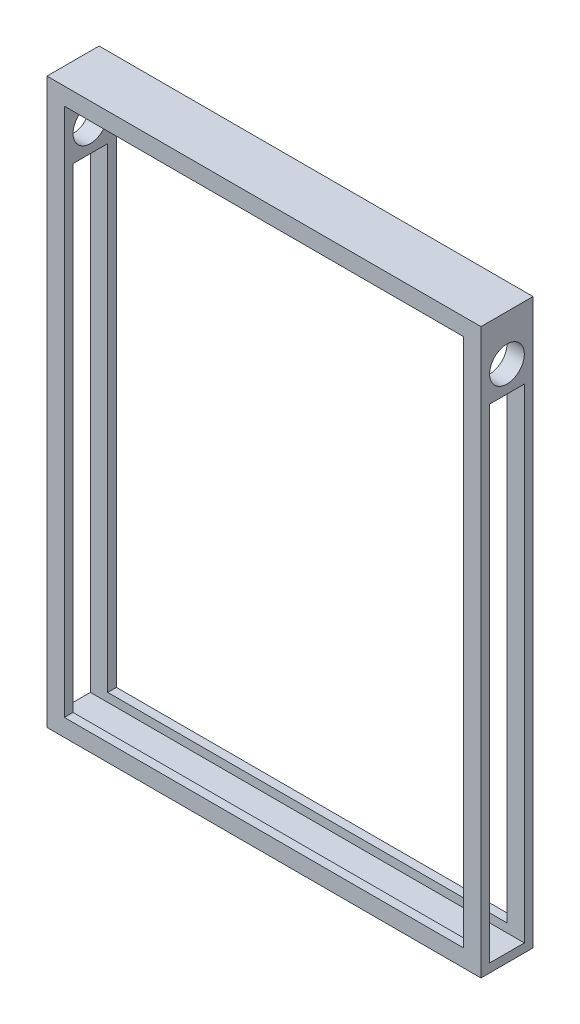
ISO-10303-21;
HEADER;
FILE_DESCRIPTION(('STEP AP214'),'2;1');
FILE_NAME('part.step','',(''),(''),'','','');
FILE_SCHEMA(('AUTOMOTIVE_DESIGN { 1 0 10303 214 1 1 1 1 }'));
ENDSEC;
DATA;
#1=APPLICATION_CONTEXT('core data for automotive mechanical design processes');
#2=APPLICATION_PROTOCOL_DEFINITION('international standard','automotive_design',2000,#1);
#3=PRODUCT_CONTEXT('',#1,'mechanical');
#4=PRODUCT('Part','Part','',(#3));
#5=PRODUCT_RELATED_PRODUCT_CATEGORY('part','',(#4));
#6=PRODUCT_DEFINITION_FORMATION('','',#4);
#7=PRODUCT_DEFINITION_CONTEXT('part definition',#1,'design');
#8=PRODUCT_DEFINITION('design','',#6,#7);
#9=PRODUCT_DEFINITION_SHAPE('','',#8);
#10=(LENGTH_UNIT() NAMED_UNIT(*) SI_UNIT(.MILLI.,.METRE.));
#11=(NAMED_UNIT(*) PLANE_ANGLE_UNIT() SI_UNIT($,.RADIAN.));
#12=(NAMED_UNIT(*) SI_UNIT($,.STERADIAN.) SOLID_ANGLE_UNIT());
#13=UNCERTAINTY_MEASURE_WITH_UNIT(LENGTH_MEASURE(1.E-05),#10,'distance_accuracy_value','');
#14=(GEOMETRIC_REPRESENTATION_CONTEXT(3) GLOBAL_UNCERTAINTY_ASSIGNED_CONTEXT((#13)) GLOBAL_UNIT_ASSIGNED_CONTEXT((#10,
#11,#12)) REPRESENTATION_CONTEXT('',''));
#15=CARTESIAN_POINT('',(0.,0.,0.));
#16=DIRECTION('',(0.,0.,1.));
#17=DIRECTION('',(1.,0.,0.));
#18=AXIS2_PLACEMENT_3D('',#15,#16,#17);
#19=CARTESIAN_POINT('',(-1113.77023346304,-32.7877431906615,152.4));
#20=DIRECTION('',(0.,1.,0.));
#21=DIRECTION('',(-1.,0.,0.));
#22=AXIS2_PLACEMENT_3D('',#19,#20,#21);
#23=PLANE('',#22);
#24=DIRECTION('',(-1.,0.,0.));
#25=VECTOR('',#24,1.);
#26=CARTESIAN_POINT('',(-1113.77023346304,-32.7877431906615,25.3999999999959));
#27=LINE('',#26,#25);
#28=CARTESIAN_POINT('',(54.629766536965,-32.7877431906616,25.3999999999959));
#29=VERTEX_POINT('',#28);
#30=CARTESIAN_POINT('',(-1113.77023346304,-32.7877431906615,25.3999999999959));
#31=VERTEX_POINT('',#30);
#32=EDGE_CURVE('E509',#29,#31,#27,.T.);
#33=ORIENTED_EDGE('',*,*,#32,.F.);
#34=DIRECTION('',(0.,0.,-1.));
#35=VECTOR('',#34,1.);
#36=CARTESIAN_POINT('',(54.629766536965,-32.7877431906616,152.4));
#37=LINE('',#36,#35);
#38=CARTESIAN_POINT('',(54.629766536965,-32.7877431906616,0.));
#39=VERTEX_POINT('',#38);
#40=EDGE_CURVE('E539',#29,#39,#37,.T.);
#41=ORIENTED_EDGE('',*,*,#40,.T.);
#42=DIRECTION('',(1.,0.,0.));
#43=VECTOR('',#42,1.);
#44=CARTESIAN_POINT('',(-1113.77023346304,-32.7877431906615,0.));
#45=LINE('',#44,#43);
#46=CARTESIAN_POINT('',(-1113.77023346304,-32.7877431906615,0.));
#47=VERTEX_POINT('',#46);
#48=EDGE_CURVE('E516',#47,#39,#45,.T.);
#49=ORIENTED_EDGE('',*,*,#48,.F.);
#50=DIRECTION('',(0.,0.,-1.));
#51=VECTOR('',#50,1.);
#52=CARTESIAN_POINT('',(-1113.77023346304,-32.7877431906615,152.4));
#53=LINE('',#52,#51);
#54=EDGE_CURVE('E543',#31,#47,#53,.T.);
#55=ORIENTED_EDGE('',*,*,#54,.F.);
#56=EDGE_LOOP('',(#33,#41,#49,#55));
#57=FACE_BOUND('',#56,.T.);
#58=ADVANCED_FACE('F350',(#57),#23,.T.);
#59=CARTESIAN_POINT('',(-1164.57023346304,-83.5877431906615,152.399999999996));
#60=DIRECTION('',(0.,0.,1.));
#61=DIRECTION('',(1.,0.,0.));
#62=AXIS2_PLACEMENT_3D('',#59,#60,#61);
#63=PLANE('',#62);
#64=DIRECTION('',(0.,-1.,0.));
#65=VECTOR('',#64,1.);
#66=CARTESIAN_POINT('',(-1164.57023346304,1567.41225680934,152.399999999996));
#67=LINE('',#66,#65);
#68=CARTESIAN_POINT('',(-1164.57023346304,1567.41225680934,152.399999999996));
#69=VERTEX_POINT('',#68);
#70=CARTESIAN_POINT('',(-1164.57023346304,-83.5877431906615,152.399999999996));
#71=VERTEX_POINT('',#70);
#72=EDGE_CURVE('E556',#69,#71,#67,.T.);
#73=ORIENTED_EDGE('',*,*,#72,.T.);
#74=DIRECTION('',(1.,0.,0.));
#75=VECTOR('',#74,1.);
#76=CARTESIAN_POINT('',(-1164.57023346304,-83.5877431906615,152.399999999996));
#77=LINE('',#76,#75);
#78=CARTESIAN_POINT('',(105.429766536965,-83.5877431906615,152.399999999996));
#79=VERTEX_POINT('',#78);
#80=EDGE_CURVE('E559',#71,#79,#77,.T.);
#81=ORIENTED_EDGE('',*,*,#80,.T.);
#82=DIRECTION('',(0.,1.,0.));
#83=VECTOR('',#82,1.);
#84=CARTESIAN_POINT('',(105.429766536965,1567.41225680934,152.399999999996));
#85=LINE('',#84,#83);
#86=CARTESIAN_POINT('',(105.429766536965,1567.41225680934,152.399999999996));
#87=VERTEX_POINT('',#86);
#88=EDGE_CURVE('E561',#79,#87,#85,.T.);
#89=ORIENTED_EDGE('',*,*,#88,.T.);
#90=DIRECTION('',(-1.,0.,0.));
#91=VECTOR('',#90,1.);
#92=CARTESIAN_POINT('',(-1164.57023346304,1567.41225680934,152.399999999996));
#93=LINE('',#92,#91);
#94=EDGE_CURVE('E563',#87,#69,#93,.T.);
#95=ORIENTED_EDGE('',*,*,#94,.T.);
#96=EDGE_LOOP('',(#73,#81,#89,#95));
#97=FACE_BOUND('',#96,.T.);
#98=DIRECTION('',(1.,0.,0.));
#99=VECTOR('',#98,1.);
#100=CARTESIAN_POINT('',(-1113.77023346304,-32.7877431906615,152.4));
#101=LINE('',#100,#99);
#102=CARTESIAN_POINT('',(-1113.77023346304,-32.7877431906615,152.4));
#103=VERTEX_POINT('',#102);
#104=CARTESIAN_POINT('',(54.629766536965,-32.7877431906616,152.4));
#105=VERTEX_POINT('',#104);
#106=EDGE_CURVE('E527',#103,#105,#101,.T.);
#107=ORIENTED_EDGE('',*,*,#106,.F.);
#108=DIRECTION('',(0.,-1.,0.));
#109=VECTOR('',#108,1.);
#110=CARTESIAN_POINT('',(-1113.77023346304,1516.61225680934,152.4));
#111=LINE('',#110,#109);
#112=CARTESIAN_POINT('',(-1113.77023346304,1516.61225680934,152.4));
#113=VERTEX_POINT('',#112);
#114=EDGE_CURVE('E525',#113,#103,#111,.T.);
#115=ORIENTED_EDGE('',*,*,#114,.F.);
#116=DIRECTION('',(-1.,0.,0.));
#117=VECTOR('',#116,1.);
#118=CARTESIAN_POINT('',(-1113.77023346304,1516.61225680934,152.4));
#119=LINE('',#118,#117);
#120=CARTESIAN_POINT('',(54.6297665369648,1516.61225680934,152.4));
#121=VERTEX_POINT('',#120);
#122=EDGE_CURVE('E532',#121,#113,#119,.T.);
#123=ORIENTED_EDGE('',*,*,#122,.F.);
#124=DIRECTION('',(0.,1.,0.));
#125=VECTOR('',#124,1.);
#126=CARTESIAN_POINT('',(54.6297665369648,1516.61225680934,152.4));
#127=LINE('',#126,#125);
#128=EDGE_CURVE('E529',#105,#121,#127,.T.);
#129=ORIENTED_EDGE('',*,*,#128,.F.);
#130=EDGE_LOOP('',(#107,#115,#123,#129));
#131=FACE_BOUND('',#130,.T.);
#132=ADVANCED_FACE('F606',(#97,#131),#63,.T.);
#133=CARTESIAN_POINT('',(-1164.57023346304,-83.5877431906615,0.));
#134=DIRECTION('',(0.,0.,1.));
#135=DIRECTION('',(1.,0.,0.));
#136=AXIS2_PLACEMENT_3D('',#133,#134,#135);
#137=PLANE('',#136);
#138=DIRECTION('',(0.,-1.,0.));
#139=VECTOR('',#138,1.);
#140=CARTESIAN_POINT('',(-1164.57023346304,1567.41225680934,0.));
#141=LINE('',#140,#139);
#142=CARTESIAN_POINT('',(-1164.57023346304,1567.41225680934,0.));
#143=VERTEX_POINT('',#142);
#144=CARTESIAN_POINT('',(-1164.57023346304,-83.5877431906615,0.));
#145=VERTEX_POINT('',#144);
#146=EDGE_CURVE('E547',#143,#145,#141,.T.);
#147=ORIENTED_EDGE('',*,*,#146,.F.);
#148=DIRECTION('',(-1.,0.,0.));
#149=VECTOR('',#148,1.);
#150=CARTESIAN_POINT('',(-1164.57023346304,1567.41225680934,0.));
#151=LINE('',#150,#149);
#152=CARTESIAN_POINT('',(105.429766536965,1567.41225680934,0.));
#153=VERTEX_POINT('',#152);
#154=EDGE_CURVE('E554',#153,#143,#151,.T.);
#155=ORIENTED_EDGE('',*,*,#154,.F.);
#156=DIRECTION('',(0.,1.,0.));
#157=VECTOR('',#156,1.);
#158=CARTESIAN_POINT('',(105.429766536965,1567.41225680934,0.));
#159=LINE('',#158,#157);
#160=CARTESIAN_POINT('',(105.429766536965,-83.5877431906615,0.));
#161=VERTEX_POINT('',#160);
#162=EDGE_CURVE('E552',#161,#153,#159,.T.);
#163=ORIENTED_EDGE('',*,*,#162,.F.);
#164=DIRECTION('',(1.,0.,0.));
#165=VECTOR('',#164,1.);
#166=CARTESIAN_POINT('',(-1164.57023346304,-83.5877431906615,0.));
#167=LINE('',#166,#165);
#168=EDGE_CURVE('E550',#145,#161,#167,.T.);
#169=ORIENTED_EDGE('',*,*,#168,.F.);
#170=EDGE_LOOP('',(#147,#155,#163,#169));
#171=FACE_BOUND('',#170,.T.);
#172=DIRECTION('',(0.,-1.,0.));
#173=VECTOR('',#172,1.);
#174=CARTESIAN_POINT('',(-1113.77023346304,1516.61225680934,0.));
#175=LINE('',#174,#173);
#176=CARTESIAN_POINT('',(-1113.77023346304,1516.61225680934,0.));
#177=VERTEX_POINT('',#176);
#178=EDGE_CURVE('E513',#177,#47,#175,.T.);
#179=ORIENTED_EDGE('',*,*,#178,.T.);
#180=ORIENTED_EDGE('',*,*,#48,.T.);
#181=DIRECTION('',(0.,1.,0.));
#182=VECTOR('',#181,1.);
#183=CARTESIAN_POINT('',(54.6297665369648,1516.61225680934,0.));
#184=LINE('',#183,#182);
#185=CARTESIAN_POINT('',(54.6297665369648,1516.61225680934,0.));
#186=VERTEX_POINT('',#185);
#187=EDGE_CURVE('E519',#39,#186,#184,.T.);
#188=ORIENTED_EDGE('',*,*,#187,.T.);
#189=DIRECTION('',(-1.,0.,0.));
#190=VECTOR('',#189,1.);
#191=CARTESIAN_POINT('',(-1113.77023346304,1516.61225680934,0.));
#192=LINE('',#191,#190);
#193=EDGE_CURVE('E522',#186,#177,#192,.T.);
#194=ORIENTED_EDGE('',*,*,#193,.T.);
#195=EDGE_LOOP('',(#179,#180,#188,#194));
#196=FACE_BOUND('',#195,.T.);
#197=ADVANCED_FACE('F595',(#171,#196),#137,.F.);
#198=CARTESIAN_POINT('',(-1164.57023346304,1567.41225680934,152.399999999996));
#199=DIRECTION('',(1.,0.,0.));
#200=DIRECTION('',(0.,0.,-1.));
#201=AXIS2_PLACEMENT_3D('',#198,#199,#200);
#202=PLANE('',#201);
#203=CARTESIAN_POINT('',(-1164.57023346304,1434.47779679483,76.1999999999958));
#204=DIRECTION('',(-1.,0.,0.));
#205=DIRECTION('',(0.,0.,1.));
#206=AXIS2_PLACEMENT_3D('',#203,#204,#205);
#207=CIRCLE('',#206,50.8);
#208=CARTESIAN_POINT('',(-1164.57023346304,1434.47779679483,126.999999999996));
#209=VERTEX_POINT('',#208);
#210=EDGE_CURVE('E684',#209,#209,#207,.T.);
#211=ORIENTED_EDGE('',*,*,#210,.F.);
#212=EDGE_LOOP('',(#211));
#213=FACE_BOUND('',#212,.T.);
#214=DIRECTION('',(0.,0.,1.));
#215=VECTOR('',#214,1.);
#216=CARTESIAN_POINT('',(-1164.57023346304,-58.1877431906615,25.3999999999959));
#217=LINE('',#216,#215);
#218=CARTESIAN_POINT('',(-1164.57023346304,-58.1877431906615,25.3999999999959));
#219=VERTEX_POINT('',#218);
#220=CARTESIAN_POINT('',(-1164.57023346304,-58.1877431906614,126.999999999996));
#221=VERTEX_POINT('',#220);
#222=EDGE_CURVE('E475',#219,#221,#217,.T.);
#223=ORIENTED_EDGE('',*,*,#222,.F.);
#224=DIRECTION('',(0.,-1.,0.));
#225=VECTOR('',#224,1.);
#226=CARTESIAN_POINT('',(-1164.57023346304,1358.27779679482,25.4));
#227=LINE('',#226,#225);
#228=CARTESIAN_POINT('',(-1164.57023346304,1358.27779679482,25.4));
#229=VERTEX_POINT('',#228);
#230=EDGE_CURVE('E365',#229,#219,#227,.T.);
#231=ORIENTED_EDGE('',*,*,#230,.F.);
#232=DIRECTION('',(0.,0.,-1.));
#233=VECTOR('',#232,1.);
#234=CARTESIAN_POINT('',(-1164.57023346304,1358.27779679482,25.4));
#235=LINE('',#234,#233);
#236=CARTESIAN_POINT('',(-1164.57023346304,1358.27779679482,127.));
#237=VERTEX_POINT('',#236);
#238=EDGE_CURVE('E481',#237,#229,#235,.T.);
#239=ORIENTED_EDGE('',*,*,#238,.F.);
#240=DIRECTION('',(0.,1.,0.));
#241=VECTOR('',#240,1.);
#242=CARTESIAN_POINT('',(-1164.57023346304,1358.27779679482,127.));
#243=LINE('',#242,#241);
#244=EDGE_CURVE('E466',#221,#237,#243,.T.);
#245=ORIENTED_EDGE('',*,*,#244,.F.);
#246=EDGE_LOOP('',(#223,#231,#239,#245));
#247=FACE_BOUND('',#246,.T.);
#248=ORIENTED_EDGE('',*,*,#146,.T.);
#249=DIRECTION('',(0.,0.,-1.));
#250=VECTOR('',#249,1.);
#251=CARTESIAN_POINT('',(-1164.57023346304,-83.5877431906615,152.399999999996));
#252=LINE('',#251,#250);
#253=EDGE_CURVE('E574',#71,#145,#252,.T.);
#254=ORIENTED_EDGE('',*,*,#253,.F.);
#255=ORIENTED_EDGE('',*,*,#72,.F.);
#256=DIRECTION('',(0.,0.,-1.));
#257=VECTOR('',#256,1.);
#258=CARTESIAN_POINT('',(-1164.57023346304,1567.41225680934,152.399999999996));
#259=LINE('',#258,#257);
#260=EDGE_CURVE('E565',#69,#143,#259,.T.);
#261=ORIENTED_EDGE('',*,*,#260,.T.);
#262=EDGE_LOOP('',(#248,#254,#255,#261));
#263=FACE_BOUND('',#262,.T.);
#264=ADVANCED_FACE('F352',(#213,#247,#263),#202,.F.);
#265=CARTESIAN_POINT('',(-1164.57023346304,-83.5877431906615,152.399999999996));
#266=DIRECTION('',(0.,1.,0.));
#267=DIRECTION('',(0.,0.,1.));
#268=AXIS2_PLACEMENT_3D('',#265,#266,#267);
#269=PLANE('',#268);
#270=ORIENTED_EDGE('',*,*,#168,.T.);
#271=DIRECTION('',(0.,0.,-1.));
#272=VECTOR('',#271,1.);
#273=CARTESIAN_POINT('',(105.429766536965,-83.5877431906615,152.399999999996));
#274=LINE('',#273,#272);
#275=EDGE_CURVE('E571',#79,#161,#274,.T.);
#276=ORIENTED_EDGE('',*,*,#275,.F.);
#277=ORIENTED_EDGE('',*,*,#80,.F.);
#278=ORIENTED_EDGE('',*,*,#253,.T.);
#279=EDGE_LOOP('',(#270,#276,#277,#278));
#280=FACE_BOUND('',#279,.T.);
#281=ADVANCED_FACE('F622',(#280),#269,.F.);
#282=CARTESIAN_POINT('',(105.429766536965,1567.41225680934,152.399999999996));
#283=DIRECTION('',(-1.,0.,0.));
#284=DIRECTION('',(0.,-1.,0.));
#285=AXIS2_PLACEMENT_3D('',#282,#283,#284);
#286=PLANE('',#285);
#287=CARTESIAN_POINT('',(105.429766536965,1434.47779679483,76.1999999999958));
#288=DIRECTION('',(-1.,0.,0.));
#289=DIRECTION('',(0.,0.,1.));
#290=AXIS2_PLACEMENT_3D('',#287,#288,#289);
#291=CIRCLE('',#290,50.8);
#292=CARTESIAN_POINT('',(105.429766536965,1434.47779679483,126.999999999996));
#293=VERTEX_POINT('',#292);
#294=EDGE_CURVE('E681',#293,#293,#291,.T.);
#295=ORIENTED_EDGE('',*,*,#294,.T.);
#296=EDGE_LOOP('',(#295));
#297=FACE_BOUND('',#296,.T.);
#298=DIRECTION('',(0.,0.,-1.));
#299=VECTOR('',#298,1.);
#300=CARTESIAN_POINT('',(105.429766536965,1358.27779679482,25.4));
#301=LINE('',#300,#299);
#302=CARTESIAN_POINT('',(105.429766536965,1358.27779679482,127.));
#303=VERTEX_POINT('',#302);
#304=CARTESIAN_POINT('',(105.429766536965,1358.27779679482,25.4));
#305=VERTEX_POINT('',#304);
#306=EDGE_CURVE('E492',#303,#305,#301,.T.);
#307=ORIENTED_EDGE('',*,*,#306,.T.);
#308=DIRECTION('',(0.,-1.,0.));
#309=VECTOR('',#308,1.);
#310=CARTESIAN_POINT('',(105.429766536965,1358.27779679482,25.4));
#311=LINE('',#310,#309);
#312=CARTESIAN_POINT('',(105.429766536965,-58.1877431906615,25.3999999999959));
#313=VERTEX_POINT('',#312);
#314=EDGE_CURVE('E483',#305,#313,#311,.T.);
#315=ORIENTED_EDGE('',*,*,#314,.T.);
#316=DIRECTION('',(0.,0.,1.));
#317=VECTOR('',#316,1.);
#318=CARTESIAN_POINT('',(105.429766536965,-58.1877431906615,25.3999999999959));
#319=LINE('',#318,#317);
#320=CARTESIAN_POINT('',(105.429766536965,-58.1877431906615,126.999999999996));
#321=VERTEX_POINT('',#320);
#322=EDGE_CURVE('E489',#313,#321,#319,.T.);
#323=ORIENTED_EDGE('',*,*,#322,.T.);
#324=DIRECTION('',(0.,1.,0.));
#325=VECTOR('',#324,1.);
#326=CARTESIAN_POINT('',(105.429766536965,1358.27779679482,127.));
#327=LINE('',#326,#325);
#328=EDGE_CURVE('E373',#321,#303,#327,.T.);
#329=ORIENTED_EDGE('',*,*,#328,.T.);
#330=EDGE_LOOP('',(#307,#315,#323,#329));
#331=FACE_BOUND('',#330,.T.);
#332=ORIENTED_EDGE('',*,*,#162,.T.);
#333=DIRECTION('',(0.,0.,-1.));
#334=VECTOR('',#333,1.);
#335=CARTESIAN_POINT('',(105.429766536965,1567.41225680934,152.399999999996));
#336=LINE('',#335,#334);
#337=EDGE_CURVE('E568',#87,#153,#336,.T.);
#338=ORIENTED_EDGE('',*,*,#337,.F.);
#339=ORIENTED_EDGE('',*,*,#88,.F.);
#340=ORIENTED_EDGE('',*,*,#275,.T.);
#341=EDGE_LOOP('',(#332,#338,#339,#340));
#342=FACE_BOUND('',#341,.T.);
#343=ADVANCED_FACE('F618',(#297,#331,#342),#286,.F.);
#344=CARTESIAN_POINT('',(-1164.57023346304,1567.41225680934,152.399999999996));
#345=DIRECTION('',(0.,-1.,0.));
#346=DIRECTION('',(0.,0.,-1.));
#347=AXIS2_PLACEMENT_3D('',#344,#345,#346);
#348=PLANE('',#347);
#349=ORIENTED_EDGE('',*,*,#154,.T.);
#350=ORIENTED_EDGE('',*,*,#260,.F.);
#351=ORIENTED_EDGE('',*,*,#94,.F.);
#352=ORIENTED_EDGE('',*,*,#337,.T.);
#353=EDGE_LOOP('',(#349,#350,#351,#352));
#354=FACE_BOUND('',#353,.T.);
#355=ADVANCED_FACE('F621',(#354),#348,.F.);
#356=CARTESIAN_POINT('',(-1113.77023346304,1516.61225680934,152.4));
#357=DIRECTION('',(1.,0.,0.));
#358=DIRECTION('',(0.,1.,0.));
#359=AXIS2_PLACEMENT_3D('',#356,#357,#358);
#360=PLANE('',#359);
#361=CARTESIAN_POINT('',(-1113.77023346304,1434.47779679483,76.1999999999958));
#362=DIRECTION('',(1.,0.,0.));
#363=DIRECTION('',(0.,1.,0.));
#364=AXIS2_PLACEMENT_3D('',#361,#362,#363);
#365=CIRCLE('',#364,50.8);
#366=CARTESIAN_POINT('',(-1113.77023346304,1485.27779679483,76.1999999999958));
#367=VERTEX_POINT('',#366);
#368=EDGE_CURVE('E679',#367,#367,#365,.T.);
#369=ORIENTED_EDGE('',*,*,#368,.F.);
#370=EDGE_LOOP('',(#369));
#371=FACE_BOUND('',#370,.T.);
#372=DIRECTION('',(0.,1.,0.));
#373=VECTOR('',#372,1.);
#374=CARTESIAN_POINT('',(-1113.77023346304,1516.61225680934,25.3999999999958));
#375=LINE('',#374,#373);
#376=CARTESIAN_POINT('',(-1113.77023346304,1358.27779679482,25.4));
#377=VERTEX_POINT('',#376);
#378=EDGE_CURVE('E511',#31,#377,#375,.T.);
#379=ORIENTED_EDGE('',*,*,#378,.F.);
#380=ORIENTED_EDGE('',*,*,#54,.T.);
#381=ORIENTED_EDGE('',*,*,#178,.F.);
#382=DIRECTION('',(0.,0.,-1.));
#383=VECTOR('',#382,1.);
#384=CARTESIAN_POINT('',(-1113.77023346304,1516.61225680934,152.4));
#385=LINE('',#384,#383);
#386=EDGE_CURVE('E534',#113,#177,#385,.T.);
#387=ORIENTED_EDGE('',*,*,#386,.F.);
#388=ORIENTED_EDGE('',*,*,#114,.T.);
#389=CARTESIAN_POINT('',(-1113.77023346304,-32.7877431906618,126.999999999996));
#390=VERTEX_POINT('',#389);
#391=EDGE_CURVE('E544',#103,#390,#53,.T.);
#392=ORIENTED_EDGE('',*,*,#391,.T.);
#393=DIRECTION('',(0.,-1.,0.));
#394=VECTOR('',#393,1.);
#395=CARTESIAN_POINT('',(-1113.77023346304,1516.61225680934,126.999999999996));
#396=LINE('',#395,#394);
#397=CARTESIAN_POINT('',(-1113.77023346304,1358.27779679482,127.));
#398=VERTEX_POINT('',#397);
#399=EDGE_CURVE('E505',#398,#390,#396,.T.);
#400=ORIENTED_EDGE('',*,*,#399,.F.);
#401=DIRECTION('',(0.,0.,1.));
#402=VECTOR('',#401,1.);
#403=CARTESIAN_POINT('',(-1113.77023346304,1358.27779679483,152.399999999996));
#404=LINE('',#403,#402);
#405=EDGE_CURVE('E507',#377,#398,#404,.T.);
#406=ORIENTED_EDGE('',*,*,#405,.F.);
#407=EDGE_LOOP('',(#379,#380,#381,#387,#388,#392,#400,#406));
#408=FACE_BOUND('',#407,.T.);
#409=ADVANCED_FACE('F598',(#371,#408),#360,.T.);
#410=DIRECTION('',(1.,0.,0.));
#411=VECTOR('',#410,1.);
#412=CARTESIAN_POINT('',(-1113.77023346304,-32.7877431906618,126.999999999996));
#413=LINE('',#412,#411);
#414=CARTESIAN_POINT('',(54.629766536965,-32.7877431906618,126.999999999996));
#415=VERTEX_POINT('',#414);
#416=EDGE_CURVE('E498',#390,#415,#413,.T.);
#417=ORIENTED_EDGE('',*,*,#416,.F.);
#418=ORIENTED_EDGE('',*,*,#391,.F.);
#419=ORIENTED_EDGE('',*,*,#106,.T.);
#420=EDGE_CURVE('E540',#105,#415,#37,.T.);
#421=ORIENTED_EDGE('',*,*,#420,.T.);
#422=EDGE_LOOP('',(#417,#418,#419,#421));
#423=FACE_BOUND('',#422,.T.);
#424=ADVANCED_FACE('F611',(#423),#23,.T.);
#425=CARTESIAN_POINT('',(54.6297665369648,1516.61225680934,152.4));
#426=DIRECTION('',(-1.,0.,0.));
#427=DIRECTION('',(0.,-1.,0.));
#428=AXIS2_PLACEMENT_3D('',#425,#426,#427);
#429=PLANE('',#428);
#430=CARTESIAN_POINT('',(54.6297665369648,1434.47779679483,76.1999999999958));
#431=DIRECTION('',(-1.,0.,0.));
#432=DIRECTION('',(0.,-1.,0.));
#433=AXIS2_PLACEMENT_3D('',#430,#431,#432);
#434=CIRCLE('',#433,50.8);
#435=CARTESIAN_POINT('',(54.6297665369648,1383.67779679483,76.1999999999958));
#436=VERTEX_POINT('',#435);
#437=EDGE_CURVE('E11',#436,#436,#434,.T.);
#438=ORIENTED_EDGE('',*,*,#437,.F.);
#439=EDGE_LOOP('',(#438));
#440=FACE_BOUND('',#439,.T.);
#441=DIRECTION('',(0.,-1.,0.));
#442=VECTOR('',#441,1.);
#443=CARTESIAN_POINT('',(54.6297665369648,1516.61225680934,25.3999999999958));
#444=LINE('',#443,#442);
#445=CARTESIAN_POINT('',(54.6297665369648,1358.27779679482,25.4));
#446=VERTEX_POINT('',#445);
#447=EDGE_CURVE('E358',#446,#29,#444,.T.);
#448=ORIENTED_EDGE('',*,*,#447,.F.);
#449=DIRECTION('',(0.,0.,-1.));
#450=VECTOR('',#449,1.);
#451=CARTESIAN_POINT('',(54.6297665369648,1358.27779679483,152.399999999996));
#452=LINE('',#451,#450);
#453=CARTESIAN_POINT('',(54.6297665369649,1358.27779679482,127.));
#454=VERTEX_POINT('',#453);
#455=EDGE_CURVE('E579',#454,#446,#452,.T.);
#456=ORIENTED_EDGE('',*,*,#455,.F.);
#457=DIRECTION('',(0.,1.,0.));
#458=VECTOR('',#457,1.);
#459=CARTESIAN_POINT('',(54.6297665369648,1516.61225680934,126.999999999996));
#460=LINE('',#459,#458);
#461=EDGE_CURVE('E577',#415,#454,#460,.T.);
#462=ORIENTED_EDGE('',*,*,#461,.F.);
#463=ORIENTED_EDGE('',*,*,#420,.F.);
#464=ORIENTED_EDGE('',*,*,#128,.T.);
#465=DIRECTION('',(0.,0.,-1.));
#466=VECTOR('',#465,1.);
#467=CARTESIAN_POINT('',(54.6297665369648,1516.61225680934,152.4));
#468=LINE('',#467,#466);
#469=EDGE_CURVE('E537',#121,#186,#468,.T.);
#470=ORIENTED_EDGE('',*,*,#469,.T.);
#471=ORIENTED_EDGE('',*,*,#187,.F.);
#472=ORIENTED_EDGE('',*,*,#40,.F.);
#473=EDGE_LOOP('',(#448,#456,#462,#463,#464,#470,#471,#472));
#474=FACE_BOUND('',#473,.T.);
#475=ADVANCED_FACE('F592',(#440,#474),#429,.T.);
#476=CARTESIAN_POINT('',(-1113.77023346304,1516.61225680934,152.4));
#477=DIRECTION('',(0.,-1.,0.));
#478=DIRECTION('',(0.,0.,-1.));
#479=AXIS2_PLACEMENT_3D('',#476,#477,#478);
#480=PLANE('',#479);
#481=ORIENTED_EDGE('',*,*,#193,.F.);
#482=ORIENTED_EDGE('',*,*,#469,.F.);
#483=ORIENTED_EDGE('',*,*,#122,.T.);
#484=ORIENTED_EDGE('',*,*,#386,.T.);
#485=EDGE_LOOP('',(#481,#482,#483,#484));
#486=FACE_BOUND('',#485,.T.);
#487=ADVANCED_FACE('F601',(#486),#480,.T.);
#488=CARTESIAN_POINT('',(105.429766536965,1358.27779679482,25.4));
#489=DIRECTION('',(0.,1.,0.));
#490=DIRECTION('',(0.,0.,1.));
#491=AXIS2_PLACEMENT_3D('',#488,#489,#490);
#492=PLANE('',#491);
#493=ORIENTED_EDGE('',*,*,#405,.T.);
#494=DIRECTION('',(-1.,0.,0.));
#495=VECTOR('',#494,1.);
#496=CARTESIAN_POINT('',(105.429766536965,1358.27779679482,127.));
#497=LINE('',#496,#495);
#498=EDGE_CURVE('E471',#398,#237,#497,.T.);
#499=ORIENTED_EDGE('',*,*,#498,.T.);
#500=ORIENTED_EDGE('',*,*,#238,.T.);
#501=DIRECTION('',(-1.,0.,0.));
#502=VECTOR('',#501,1.);
#503=CARTESIAN_POINT('',(105.429766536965,1358.27779679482,25.4));
#504=LINE('',#503,#502);
#505=EDGE_CURVE('E499',#377,#229,#504,.T.);
#506=ORIENTED_EDGE('',*,*,#505,.F.);
#507=EDGE_LOOP('',(#493,#499,#500,#506));
#508=FACE_BOUND('',#507,.T.);
#509=ADVANCED_FACE('F701',(#508),#492,.F.);
#510=CARTESIAN_POINT('',(105.429766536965,1358.27779679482,25.4));
#511=DIRECTION('',(0.,0.,-1.));
#512=DIRECTION('',(0.,1.,0.));
#513=AXIS2_PLACEMENT_3D('',#510,#511,#512);
#514=PLANE('',#513);
#515=ORIENTED_EDGE('',*,*,#378,.T.);
#516=ORIENTED_EDGE('',*,*,#505,.T.);
#517=ORIENTED_EDGE('',*,*,#230,.T.);
#518=DIRECTION('',(-1.,0.,0.));
#519=VECTOR('',#518,1.);
#520=CARTESIAN_POINT('',(105.429766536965,-58.1877431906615,25.3999999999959));
#521=LINE('',#520,#519);
#522=EDGE_CURVE('E472',#313,#219,#521,.T.);
#523=ORIENTED_EDGE('',*,*,#522,.F.);
#524=ORIENTED_EDGE('',*,*,#314,.F.);
#525=EDGE_CURVE('E495',#305,#446,#504,.T.);
#526=ORIENTED_EDGE('',*,*,#525,.T.);
#527=ORIENTED_EDGE('',*,*,#447,.T.);
#528=ORIENTED_EDGE('',*,*,#32,.T.);
#529=EDGE_LOOP('',(#515,#516,#517,#523,#524,#526,#527,#528));
#530=FACE_BOUND('',#529,.T.);
#531=ADVANCED_FACE('F582',(#530),#514,.F.);
#532=ORIENTED_EDGE('',*,*,#455,.T.);
#533=ORIENTED_EDGE('',*,*,#525,.F.);
#534=ORIENTED_EDGE('',*,*,#306,.F.);
#535=EDGE_CURVE('E500',#303,#454,#497,.T.);
#536=ORIENTED_EDGE('',*,*,#535,.T.);
#537=EDGE_LOOP('',(#532,#533,#534,#536));
#538=FACE_BOUND('',#537,.T.);
#539=ADVANCED_FACE('F615',(#538),#492,.F.);
#540=CARTESIAN_POINT('',(105.429766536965,1358.27779679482,127.));
#541=DIRECTION('',(0.,0.,1.));
#542=DIRECTION('',(0.,-1.,0.));
#543=AXIS2_PLACEMENT_3D('',#540,#541,#542);
#544=PLANE('',#543);
#545=ORIENTED_EDGE('',*,*,#399,.T.);
#546=ORIENTED_EDGE('',*,*,#416,.T.);
#547=ORIENTED_EDGE('',*,*,#461,.T.);
#548=ORIENTED_EDGE('',*,*,#535,.F.);
#549=ORIENTED_EDGE('',*,*,#328,.F.);
#550=DIRECTION('',(-1.,0.,0.));
#551=VECTOR('',#550,1.);
#552=CARTESIAN_POINT('',(105.429766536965,-58.1877431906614,126.999999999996));
#553=LINE('',#552,#551);
#554=EDGE_CURVE('E461',#321,#221,#553,.T.);
#555=ORIENTED_EDGE('',*,*,#554,.T.);
#556=ORIENTED_EDGE('',*,*,#244,.T.);
#557=ORIENTED_EDGE('',*,*,#498,.F.);
#558=EDGE_LOOP('',(#545,#546,#547,#548,#549,#555,#556,#557));
#559=FACE_BOUND('',#558,.T.);
#560=ADVANCED_FACE('F463',(#559),#544,.F.);
#561=CARTESIAN_POINT('',(105.429766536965,-58.1877431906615,25.3999999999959));
#562=DIRECTION('',(0.,-1.,0.));
#563=DIRECTION('',(0.,0.,-1.));
#564=AXIS2_PLACEMENT_3D('',#561,#562,#563);
#565=PLANE('',#564);
#566=ORIENTED_EDGE('',*,*,#222,.T.);
#567=ORIENTED_EDGE('',*,*,#554,.F.);
#568=ORIENTED_EDGE('',*,*,#322,.F.);
#569=ORIENTED_EDGE('',*,*,#522,.T.);
#570=EDGE_LOOP('',(#566,#567,#568,#569));
#571=FACE_BOUND('',#570,.T.);
#572=ADVANCED_FACE('F476',(#571),#565,.F.);
#573=CARTESIAN_POINT('',(105.429766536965,1434.47779679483,76.1999999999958));
#574=DIRECTION('',(-1.,0.,0.));
#575=DIRECTION('',(0.,0.,1.));
#576=AXIS2_PLACEMENT_3D('',#573,#574,#575);
#577=CYLINDRICAL_SURFACE('',#576,50.8);
#578=ORIENTED_EDGE('',*,*,#437,.T.);
#579=EDGE_LOOP('',(#578));
#580=FACE_BOUND('',#579,.T.);
#581=ORIENTED_EDGE('',*,*,#294,.F.);
#582=EDGE_LOOP('',(#581));
#583=FACE_BOUND('',#582,.T.);
#584=ADVANCED_FACE('F692',(#580,#583),#577,.F.);
#585=ORIENTED_EDGE('',*,*,#368,.T.);
#586=EDGE_LOOP('',(#585));
#587=FACE_BOUND('',#586,.T.);
#588=ORIENTED_EDGE('',*,*,#210,.T.);
#589=EDGE_LOOP('',(#588));
#590=FACE_BOUND('',#589,.T.);
#591=ADVANCED_FACE('F690',(#587,#590),#577,.F.);
#592=CLOSED_SHELL('',(#58,#132,#197,#264,#281,#343,#355,#409,#424,#475,#487,#509,#531,#539,#560,
#572,#584,#591));
#593=MANIFOLD_SOLID_BREP('B2',#592);
#594=ADVANCED_BREP_SHAPE_REPRESENTATION('',(#18,#593),#14);
#595=SHAPE_DEFINITION_REPRESENTATION(#9,#594);
ENDSEC;
END-ISO-10303-21;
